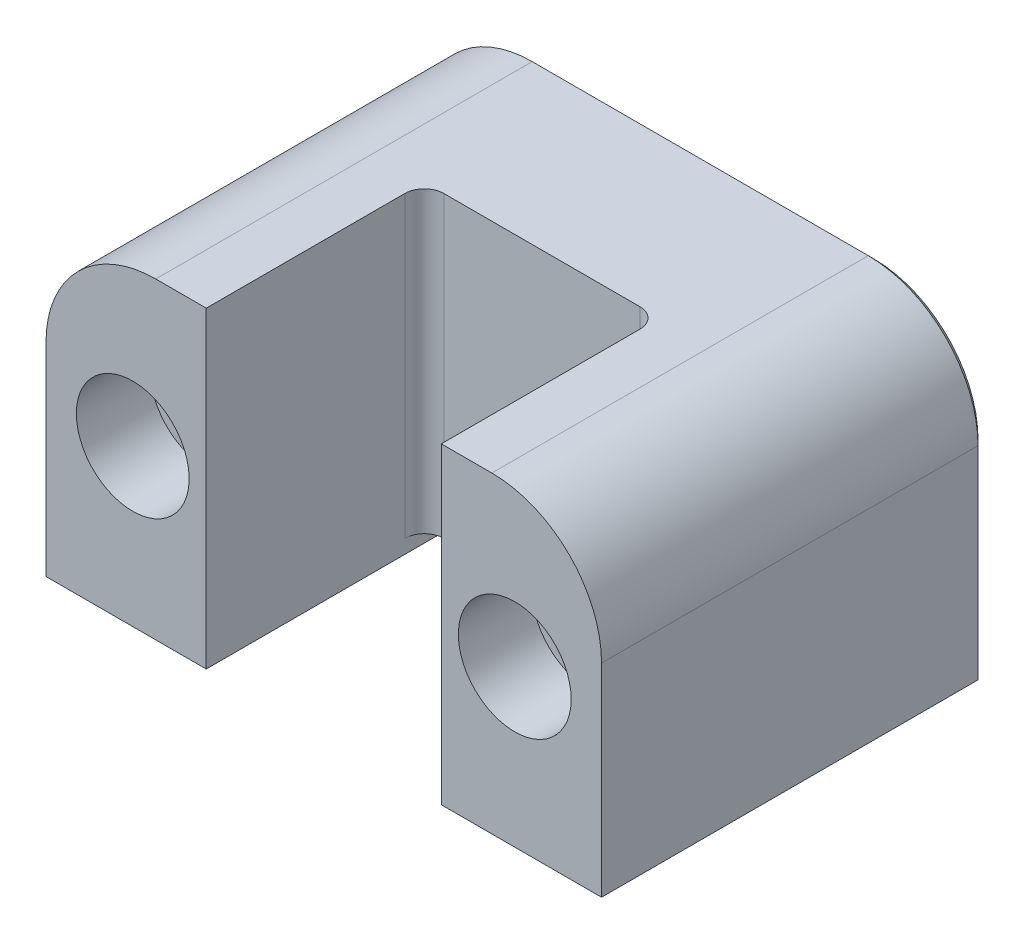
ISO-10303-21;
HEADER;
FILE_DESCRIPTION(('STEP AP214'),'2;1');
FILE_NAME('part.step','',(''),(''),'','','');
FILE_SCHEMA(('AUTOMOTIVE_DESIGN { 1 0 10303 214 1 1 1 1 }'));
ENDSEC;
DATA;
#1=APPLICATION_CONTEXT('core data for automotive mechanical design processes');
#2=APPLICATION_PROTOCOL_DEFINITION('international standard','automotive_design',2000,#1);
#3=PRODUCT_CONTEXT('',#1,'mechanical');
#4=PRODUCT('Part','Part','',(#3));
#5=PRODUCT_RELATED_PRODUCT_CATEGORY('part','',(#4));
#6=PRODUCT_DEFINITION_FORMATION('','',#4);
#7=PRODUCT_DEFINITION_CONTEXT('part definition',#1,'design');
#8=PRODUCT_DEFINITION('design','',#6,#7);
#9=PRODUCT_DEFINITION_SHAPE('','',#8);
#10=(LENGTH_UNIT() NAMED_UNIT(*) SI_UNIT(.MILLI.,.METRE.));
#11=(NAMED_UNIT(*) PLANE_ANGLE_UNIT() SI_UNIT($,.RADIAN.));
#12=(NAMED_UNIT(*) SI_UNIT($,.STERADIAN.) SOLID_ANGLE_UNIT());
#13=UNCERTAINTY_MEASURE_WITH_UNIT(LENGTH_MEASURE(1.E-05),#10,'distance_accuracy_value','');
#14=(GEOMETRIC_REPRESENTATION_CONTEXT(3) GLOBAL_UNCERTAINTY_ASSIGNED_CONTEXT((#13)) GLOBAL_UNIT_ASSIGNED_CONTEXT((#10,
#11,#12)) REPRESENTATION_CONTEXT('',''));
#15=CARTESIAN_POINT('',(0.,0.,0.));
#16=DIRECTION('',(0.,0.,1.));
#17=DIRECTION('',(1.,0.,0.));
#18=AXIS2_PLACEMENT_3D('',#15,#16,#17);
#19=CARTESIAN_POINT('',(-25.39365,28.575,-34.925));
#20=DIRECTION('',(0.,0.,1.));
#21=DIRECTION('',(1.,0.,0.));
#22=AXIS2_PLACEMENT_3D('',#19,#20,#21);
#23=PLANE('',#22);
#24=CARTESIAN_POINT('',(-17.4625,14.2875,-34.925));
#25=DIRECTION('',(0.,0.,-1.));
#26=DIRECTION('',(-1.,0.,0.));
#27=AXIS2_PLACEMENT_3D('',#24,#25,#26);
#28=CIRCLE('',#27,3.5687);
#29=CARTESIAN_POINT('',(-21.0312,14.2875,-34.925));
#30=VERTEX_POINT('',#29);
#31=EDGE_CURVE('E322',#30,#30,#28,.T.);
#32=ORIENTED_EDGE('',*,*,#31,.F.);
#33=EDGE_LOOP('',(#32));
#34=FACE_BOUND('',#33,.T.);
#35=CARTESIAN_POINT('',(15.36065,18.542,-34.925));
#36=DIRECTION('',(0.,0.,1.));
#37=DIRECTION('',(1.,0.,0.));
#38=AXIS2_PLACEMENT_3D('',#35,#36,#37);
#39=CIRCLE('',#38,9.52500000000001);
#40=CARTESIAN_POINT('',(15.36065,28.067,-34.925));
#41=VERTEX_POINT('',#40);
#42=CARTESIAN_POINT('',(24.88565,18.542,-34.925));
#43=VERTEX_POINT('',#42);
#44=EDGE_CURVE('E275',#41,#43,#39,.F.);
#45=ORIENTED_EDGE('',*,*,#44,.T.);
#46=DIRECTION('',(0.,-1.,0.));
#47=VECTOR('',#46,1.);
#48=CARTESIAN_POINT('',(24.88565,28.575,-34.925));
#49=LINE('',#48,#47);
#50=CARTESIAN_POINT('',(24.88565,0.,-34.925));
#51=VERTEX_POINT('',#50);
#52=EDGE_CURVE('E279',#43,#51,#49,.T.);
#53=ORIENTED_EDGE('',*,*,#52,.T.);
#54=DIRECTION('',(-1.,0.,0.));
#55=VECTOR('',#54,1.);
#56=CARTESIAN_POINT('',(-25.39365,0.,-34.925));
#57=LINE('',#56,#55);
#58=CARTESIAN_POINT('',(-24.88565,0.,-34.925));
#59=VERTEX_POINT('',#58);
#60=EDGE_CURVE('E173',#51,#59,#57,.T.);
#61=ORIENTED_EDGE('',*,*,#60,.T.);
#62=DIRECTION('',(0.,1.,0.));
#63=VECTOR('',#62,1.);
#64=CARTESIAN_POINT('',(-24.88565,28.575,-34.925));
#65=LINE('',#64,#63);
#66=CARTESIAN_POINT('',(-24.88565,18.542,-34.925));
#67=VERTEX_POINT('',#66);
#68=EDGE_CURVE('E277',#59,#67,#65,.T.);
#69=ORIENTED_EDGE('',*,*,#68,.T.);
#70=CARTESIAN_POINT('',(-15.36065,18.542,-34.925));
#71=DIRECTION('',(0.,0.,1.));
#72=DIRECTION('',(1.,0.,0.));
#73=AXIS2_PLACEMENT_3D('',#70,#71,#72);
#74=CIRCLE('',#73,9.52500000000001);
#75=CARTESIAN_POINT('',(-15.36065,28.067,-34.925));
#76=VERTEX_POINT('',#75);
#77=EDGE_CURVE('E273',#67,#76,#74,.F.);
#78=ORIENTED_EDGE('',*,*,#77,.T.);
#79=DIRECTION('',(1.,0.,0.));
#80=VECTOR('',#79,1.);
#81=CARTESIAN_POINT('',(-25.39365,28.067,-34.925));
#82=LINE('',#81,#80);
#83=EDGE_CURVE('E271',#76,#41,#82,.T.);
#84=ORIENTED_EDGE('',*,*,#83,.T.);
#85=EDGE_LOOP('',(#45,#53,#61,#69,#78,#84));
#86=FACE_BOUND('',#85,.T.);
#87=CARTESIAN_POINT('',(17.4625,14.2875,-34.925));
#88=DIRECTION('',(0.,0.,1.));
#89=DIRECTION('',(1.,0.,0.));
#90=AXIS2_PLACEMENT_3D('',#87,#88,#89);
#91=CIRCLE('',#90,3.5687);
#92=CARTESIAN_POINT('',(21.0312,14.2875,-34.925));
#93=VERTEX_POINT('',#92);
#94=EDGE_CURVE('E303',#93,#93,#91,.T.);
#95=ORIENTED_EDGE('',*,*,#94,.T.);
#96=EDGE_LOOP('',(#95));
#97=FACE_BOUND('',#96,.T.);
#98=ADVANCED_FACE('F32',(#34,#86,#97),#23,.F.);
#99=CARTESIAN_POINT('',(10.7442,28.575,0.));
#100=DIRECTION('',(0.,0.,-1.));
#101=DIRECTION('',(-1.,0.,0.));
#102=AXIS2_PLACEMENT_3D('',#99,#100,#101);
#103=PLANE('',#102);
#104=DIRECTION('',(0.,-1.,0.));
#105=VECTOR('',#104,1.);
#106=CARTESIAN_POINT('',(25.39365,28.575,0.));
#107=LINE('',#106,#105);
#108=CARTESIAN_POINT('',(25.39365,18.542,0.));
#109=VERTEX_POINT('',#108);
#110=CARTESIAN_POINT('',(25.39365,0.,0.));
#111=VERTEX_POINT('',#110);
#112=EDGE_CURVE('E202',#109,#111,#107,.T.);
#113=ORIENTED_EDGE('',*,*,#112,.F.);
#114=CARTESIAN_POINT('',(15.36065,18.542,0.));
#115=DIRECTION('',(0.,0.,-1.));
#116=DIRECTION('',(-1.,0.,0.));
#117=AXIS2_PLACEMENT_3D('',#114,#115,#116);
#118=CIRCLE('',#117,10.033);
#119=CARTESIAN_POINT('',(15.36065,28.575,0.));
#120=VERTEX_POINT('',#119);
#121=EDGE_CURVE('E264',#109,#120,#118,.F.);
#122=ORIENTED_EDGE('',*,*,#121,.T.);
#123=DIRECTION('',(1.,0.,0.));
#124=VECTOR('',#123,1.);
#125=CARTESIAN_POINT('',(10.7442,28.575,0.));
#126=LINE('',#125,#124);
#127=CARTESIAN_POINT('',(10.7442,28.575,0.));
#128=VERTEX_POINT('',#127);
#129=EDGE_CURVE('E199',#128,#120,#126,.T.);
#130=ORIENTED_EDGE('',*,*,#129,.F.);
#131=DIRECTION('',(0.,-1.,0.));
#132=VECTOR('',#131,1.);
#133=CARTESIAN_POINT('',(10.7442,28.575,0.));
#134=LINE('',#133,#132);
#135=CARTESIAN_POINT('',(10.7442,0.,0.));
#136=VERTEX_POINT('',#135);
#137=EDGE_CURVE('E186',#128,#136,#134,.T.);
#138=ORIENTED_EDGE('',*,*,#137,.T.);
#139=DIRECTION('',(1.,0.,0.));
#140=VECTOR('',#139,1.);
#141=CARTESIAN_POINT('',(10.7442,0.,0.));
#142=LINE('',#141,#140);
#143=EDGE_CURVE('E211',#136,#111,#142,.T.);
#144=ORIENTED_EDGE('',*,*,#143,.T.);
#145=EDGE_LOOP('',(#113,#122,#130,#138,#144));
#146=FACE_BOUND('',#145,.T.);
#147=CARTESIAN_POINT('',(17.4625,14.2875,0.));
#148=DIRECTION('',(0.,0.,1.));
#149=DIRECTION('',(1.,0.,0.));
#150=AXIS2_PLACEMENT_3D('',#147,#148,#149);
#151=CIRCLE('',#150,5.1562);
#152=CARTESIAN_POINT('',(22.6187,14.2875,0.));
#153=VERTEX_POINT('',#152);
#154=EDGE_CURVE('E319',#153,#153,#151,.T.);
#155=ORIENTED_EDGE('',*,*,#154,.F.);
#156=EDGE_LOOP('',(#155));
#157=FACE_BOUND('',#156,.T.);
#158=ADVANCED_FACE('F367',(#146,#157),#103,.F.);
#159=CARTESIAN_POINT('',(-25.39365,28.575,0.));
#160=DIRECTION('',(0.,0.,-1.));
#161=DIRECTION('',(-1.,0.,0.));
#162=AXIS2_PLACEMENT_3D('',#159,#160,#161);
#163=PLANE('',#162);
#164=DIRECTION('',(1.,0.,0.));
#165=VECTOR('',#164,1.);
#166=CARTESIAN_POINT('',(-25.39365,28.575,0.));
#167=LINE('',#166,#165);
#168=CARTESIAN_POINT('',(-15.36065,28.575,0.));
#169=VERTEX_POINT('',#168);
#170=CARTESIAN_POINT('',(-10.7442,28.575,0.));
#171=VERTEX_POINT('',#170);
#172=EDGE_CURVE('E164',#169,#171,#167,.T.);
#173=ORIENTED_EDGE('',*,*,#172,.F.);
#174=CARTESIAN_POINT('',(-15.36065,18.542,0.));
#175=DIRECTION('',(0.,0.,-1.));
#176=DIRECTION('',(-1.,0.,0.));
#177=AXIS2_PLACEMENT_3D('',#174,#175,#176);
#178=CIRCLE('',#177,10.033);
#179=CARTESIAN_POINT('',(-25.39365,18.542,0.));
#180=VERTEX_POINT('',#179);
#181=EDGE_CURVE('E266',#169,#180,#178,.F.);
#182=ORIENTED_EDGE('',*,*,#181,.T.);
#183=DIRECTION('',(0.,-1.,0.));
#184=VECTOR('',#183,1.);
#185=CARTESIAN_POINT('',(-25.39365,28.575,0.));
#186=LINE('',#185,#184);
#187=CARTESIAN_POINT('',(-25.39365,0.,0.));
#188=VERTEX_POINT('',#187);
#189=EDGE_CURVE('E185',#180,#188,#186,.T.);
#190=ORIENTED_EDGE('',*,*,#189,.T.);
#191=DIRECTION('',(1.,0.,0.));
#192=VECTOR('',#191,1.);
#193=CARTESIAN_POINT('',(-25.39365,0.,0.));
#194=LINE('',#193,#192);
#195=CARTESIAN_POINT('',(-10.7442,0.,0.));
#196=VERTEX_POINT('',#195);
#197=EDGE_CURVE('E181',#188,#196,#194,.T.);
#198=ORIENTED_EDGE('',*,*,#197,.T.);
#199=DIRECTION('',(0.,-1.,0.));
#200=VECTOR('',#199,1.);
#201=CARTESIAN_POINT('',(-10.7442,28.575,0.));
#202=LINE('',#201,#200);
#203=EDGE_CURVE('E176',#171,#196,#202,.T.);
#204=ORIENTED_EDGE('',*,*,#203,.F.);
#205=EDGE_LOOP('',(#173,#182,#190,#198,#204));
#206=FACE_BOUND('',#205,.T.);
#207=CARTESIAN_POINT('',(-17.4625,14.2875,0.));
#208=DIRECTION('',(0.,0.,-1.));
#209=DIRECTION('',(-1.,0.,0.));
#210=AXIS2_PLACEMENT_3D('',#207,#208,#209);
#211=CIRCLE('',#210,5.1562);
#212=CARTESIAN_POINT('',(-22.6187,14.2875,0.));
#213=VERTEX_POINT('',#212);
#214=EDGE_CURVE('E331',#213,#213,#211,.T.);
#215=ORIENTED_EDGE('',*,*,#214,.T.);
#216=EDGE_LOOP('',(#215));
#217=FACE_BOUND('',#216,.T.);
#218=ADVANCED_FACE('F177',(#206,#217),#163,.F.);
#219=CARTESIAN_POINT('',(-25.39365,28.575,0.));
#220=DIRECTION('',(1.,0.,0.));
#221=DIRECTION('',(0.,0.,-1.));
#222=AXIS2_PLACEMENT_3D('',#219,#220,#221);
#223=PLANE('',#222);
#224=DIRECTION('',(0.,0.,1.));
#225=VECTOR('',#224,1.);
#226=CARTESIAN_POINT('',(-25.39365,18.542,0.));
#227=LINE('',#226,#225);
#228=CARTESIAN_POINT('',(-25.39365,18.542,-34.417));
#229=VERTEX_POINT('',#228);
#230=EDGE_CURVE('E268',#180,#229,#227,.F.);
#231=ORIENTED_EDGE('',*,*,#230,.T.);
#232=DIRECTION('',(0.,-1.,0.));
#233=VECTOR('',#232,1.);
#234=CARTESIAN_POINT('',(-25.39365,28.575,-34.417));
#235=LINE('',#234,#233);
#236=CARTESIAN_POINT('',(-25.39365,0.,-34.417));
#237=VERTEX_POINT('',#236);
#238=EDGE_CURVE('E288',#229,#237,#235,.T.);
#239=ORIENTED_EDGE('',*,*,#238,.T.);
#240=DIRECTION('',(0.,0.,1.));
#241=VECTOR('',#240,1.);
#242=CARTESIAN_POINT('',(-25.39365,0.,0.));
#243=LINE('',#242,#241);
#244=EDGE_CURVE('E203',#237,#188,#243,.T.);
#245=ORIENTED_EDGE('',*,*,#244,.T.);
#246=ORIENTED_EDGE('',*,*,#189,.F.);
#247=EDGE_LOOP('',(#231,#239,#245,#246));
#248=FACE_BOUND('',#247,.T.);
#249=ADVANCED_FACE('F420',(#248),#223,.F.);
#250=CARTESIAN_POINT('',(-10.7442,28.575,0.));
#251=DIRECTION('',(-1.,0.,0.));
#252=DIRECTION('',(0.,0.,1.));
#253=AXIS2_PLACEMENT_3D('',#250,#251,#252);
#254=PLANE('',#253);
#255=DIRECTION('',(0.,0.,-1.));
#256=VECTOR('',#255,1.);
#257=CARTESIAN_POINT('',(-10.7442,1.27,-26.543));
#258=LINE('',#257,#256);
#259=CARTESIAN_POINT('',(-10.7442,1.27,-18.161));
#260=VERTEX_POINT('',#259);
#261=CARTESIAN_POINT('',(-10.7442,1.27,-24.511));
#262=VERTEX_POINT('',#261);
#263=EDGE_CURVE('E335',#260,#262,#258,.T.);
#264=ORIENTED_EDGE('',*,*,#263,.F.);
#265=DIRECTION('',(0.,-1.,0.));
#266=VECTOR('',#265,1.);
#267=CARTESIAN_POINT('',(-10.7442,28.575,-18.161));
#268=LINE('',#267,#266);
#269=CARTESIAN_POINT('',(-10.7442,28.575,-18.161));
#270=VERTEX_POINT('',#269);
#271=EDGE_CURVE('E190',#260,#270,#268,.F.);
#272=ORIENTED_EDGE('',*,*,#271,.T.);
#273=DIRECTION('',(0.,0.,-1.));
#274=VECTOR('',#273,1.);
#275=CARTESIAN_POINT('',(-10.7442,28.575,0.));
#276=LINE('',#275,#274);
#277=EDGE_CURVE('E168',#171,#270,#276,.T.);
#278=ORIENTED_EDGE('',*,*,#277,.F.);
#279=ORIENTED_EDGE('',*,*,#203,.T.);
#280=DIRECTION('',(0.,0.,-1.));
#281=VECTOR('',#280,1.);
#282=CARTESIAN_POINT('',(-10.7442,0.,0.));
#283=LINE('',#282,#281);
#284=CARTESIAN_POINT('',(-10.7442,0.,-24.511));
#285=VERTEX_POINT('',#284);
#286=EDGE_CURVE('E207',#196,#285,#283,.T.);
#287=ORIENTED_EDGE('',*,*,#286,.T.);
#288=DIRECTION('',(0.,-1.,0.));
#289=VECTOR('',#288,1.);
#290=CARTESIAN_POINT('',(-10.7442,1.27,-24.511));
#291=LINE('',#290,#289);
#292=EDGE_CURVE('E235',#285,#262,#291,.F.);
#293=ORIENTED_EDGE('',*,*,#292,.T.);
#294=EDGE_LOOP('',(#264,#272,#278,#279,#287,#293));
#295=FACE_BOUND('',#294,.T.);
#296=ADVANCED_FACE('F188',(#295),#254,.F.);
#297=CARTESIAN_POINT('',(-10.7442,28.575,-19.939));
#298=DIRECTION('',(0.,0.,-1.));
#299=DIRECTION('',(-1.,0.,0.));
#300=AXIS2_PLACEMENT_3D('',#297,#298,#299);
#301=PLANE('',#300);
#302=DIRECTION('',(1.,0.,0.));
#303=VECTOR('',#302,1.);
#304=CARTESIAN_POINT('',(-10.7442,1.27,-19.939));
#305=LINE('',#304,#303);
#306=CARTESIAN_POINT('',(-8.9662,1.27,-19.939));
#307=VERTEX_POINT('',#306);
#308=CARTESIAN_POINT('',(8.9662,1.27,-19.939));
#309=VERTEX_POINT('',#308);
#310=EDGE_CURVE('E205',#307,#309,#305,.T.);
#311=ORIENTED_EDGE('',*,*,#310,.T.);
#312=DIRECTION('',(0.,-1.,0.));
#313=VECTOR('',#312,1.);
#314=CARTESIAN_POINT('',(8.9662,28.575,-19.939));
#315=LINE('',#314,#313);
#316=CARTESIAN_POINT('',(8.9662,28.575,-19.939));
#317=VERTEX_POINT('',#316);
#318=EDGE_CURVE('E247',#309,#317,#315,.F.);
#319=ORIENTED_EDGE('',*,*,#318,.T.);
#320=DIRECTION('',(1.,0.,0.));
#321=VECTOR('',#320,1.);
#322=CARTESIAN_POINT('',(-10.7442,28.575,-19.939));
#323=LINE('',#322,#321);
#324=CARTESIAN_POINT('',(-8.9662,28.575,-19.939));
#325=VERTEX_POINT('',#324);
#326=EDGE_CURVE('E191',#325,#317,#323,.T.);
#327=ORIENTED_EDGE('',*,*,#326,.F.);
#328=DIRECTION('',(0.,-1.,0.));
#329=VECTOR('',#328,1.);
#330=CARTESIAN_POINT('',(-8.9662,1.27,-19.939));
#331=LINE('',#330,#329);
#332=EDGE_CURVE('E244',#325,#307,#331,.T.);
#333=ORIENTED_EDGE('',*,*,#332,.T.);
#334=EDGE_LOOP('',(#311,#319,#327,#333));
#335=FACE_BOUND('',#334,.T.);
#336=ADVANCED_FACE('F348',(#335),#301,.F.);
#337=CARTESIAN_POINT('',(10.7442,28.575,0.));
#338=DIRECTION('',(1.,0.,0.));
#339=DIRECTION('',(0.,0.,-1.));
#340=AXIS2_PLACEMENT_3D('',#337,#338,#339);
#341=PLANE('',#340);
#342=DIRECTION('',(0.,0.,1.));
#343=VECTOR('',#342,1.);
#344=CARTESIAN_POINT('',(10.7442,28.575,0.));
#345=LINE('',#344,#343);
#346=CARTESIAN_POINT('',(10.7442,28.575,-18.161));
#347=VERTEX_POINT('',#346);
#348=EDGE_CURVE('E194',#347,#128,#345,.T.);
#349=ORIENTED_EDGE('',*,*,#348,.F.);
#350=DIRECTION('',(0.,-1.,0.));
#351=VECTOR('',#350,1.);
#352=CARTESIAN_POINT('',(10.7442,1.27,-18.161));
#353=LINE('',#352,#351);
#354=CARTESIAN_POINT('',(10.7442,1.27,-18.161));
#355=VERTEX_POINT('',#354);
#356=EDGE_CURVE('E241',#347,#355,#353,.T.);
#357=ORIENTED_EDGE('',*,*,#356,.T.);
#358=DIRECTION('',(0.,0.,1.));
#359=VECTOR('',#358,1.);
#360=CARTESIAN_POINT('',(10.7442,1.27,-26.543));
#361=LINE('',#360,#359);
#362=CARTESIAN_POINT('',(10.7442,1.27,-24.511));
#363=VERTEX_POINT('',#362);
#364=EDGE_CURVE('E341',#363,#355,#361,.T.);
#365=ORIENTED_EDGE('',*,*,#364,.F.);
#366=DIRECTION('',(0.,-1.,0.));
#367=VECTOR('',#366,1.);
#368=CARTESIAN_POINT('',(10.7442,0.,-24.511));
#369=LINE('',#368,#367);
#370=CARTESIAN_POINT('',(10.7442,0.,-24.511));
#371=VERTEX_POINT('',#370);
#372=EDGE_CURVE('E223',#363,#371,#369,.T.);
#373=ORIENTED_EDGE('',*,*,#372,.T.);
#374=DIRECTION('',(0.,0.,1.));
#375=VECTOR('',#374,1.);
#376=CARTESIAN_POINT('',(10.7442,0.,0.));
#377=LINE('',#376,#375);
#378=EDGE_CURVE('E209',#371,#136,#377,.T.);
#379=ORIENTED_EDGE('',*,*,#378,.T.);
#380=ORIENTED_EDGE('',*,*,#137,.F.);
#381=EDGE_LOOP('',(#349,#357,#365,#373,#379,#380));
#382=FACE_BOUND('',#381,.T.);
#383=ADVANCED_FACE('F360',(#382),#341,.F.);
#384=CARTESIAN_POINT('',(25.39365,28.575,0.));
#385=DIRECTION('',(-1.,0.,0.));
#386=DIRECTION('',(0.,0.,1.));
#387=AXIS2_PLACEMENT_3D('',#384,#385,#386);
#388=PLANE('',#387);
#389=DIRECTION('',(0.,0.,-1.));
#390=VECTOR('',#389,1.);
#391=CARTESIAN_POINT('',(25.39365,0.,0.));
#392=LINE('',#391,#390);
#393=CARTESIAN_POINT('',(25.39365,0.,-34.417));
#394=VERTEX_POINT('',#393);
#395=EDGE_CURVE('E214',#111,#394,#392,.T.);
#396=ORIENTED_EDGE('',*,*,#395,.T.);
#397=DIRECTION('',(0.,1.,0.));
#398=VECTOR('',#397,1.);
#399=CARTESIAN_POINT('',(25.39365,28.575,-34.417));
#400=LINE('',#399,#398);
#401=CARTESIAN_POINT('',(25.39365,18.542,-34.417));
#402=VERTEX_POINT('',#401);
#403=EDGE_CURVE('E286',#394,#402,#400,.T.);
#404=ORIENTED_EDGE('',*,*,#403,.T.);
#405=DIRECTION('',(0.,0.,-1.));
#406=VECTOR('',#405,1.);
#407=CARTESIAN_POINT('',(25.39365,18.542,0.));
#408=LINE('',#407,#406);
#409=EDGE_CURVE('E262',#402,#109,#408,.F.);
#410=ORIENTED_EDGE('',*,*,#409,.T.);
#411=ORIENTED_EDGE('',*,*,#112,.T.);
#412=EDGE_LOOP('',(#396,#404,#410,#411));
#413=FACE_BOUND('',#412,.T.);
#414=ADVANCED_FACE('F411',(#413),#388,.F.);
#415=CARTESIAN_POINT('',(-25.39365,28.575,-34.925));
#416=DIRECTION('',(0.,-1.,0.));
#417=DIRECTION('',(0.,0.,-1.));
#418=AXIS2_PLACEMENT_3D('',#415,#416,#417);
#419=PLANE('',#418);
#420=DIRECTION('',(0.,0.,-1.));
#421=VECTOR('',#420,1.);
#422=CARTESIAN_POINT('',(15.36065,28.575,-34.925));
#423=LINE('',#422,#421);
#424=CARTESIAN_POINT('',(15.36065,28.575,-34.417));
#425=VERTEX_POINT('',#424);
#426=EDGE_CURVE('E260',#120,#425,#423,.T.);
#427=ORIENTED_EDGE('',*,*,#426,.T.);
#428=DIRECTION('',(-1.,0.,0.));
#429=VECTOR('',#428,1.);
#430=CARTESIAN_POINT('',(-25.39365,28.575,-34.417));
#431=LINE('',#430,#429);
#432=CARTESIAN_POINT('',(-15.36065,28.575,-34.417));
#433=VERTEX_POINT('',#432);
#434=EDGE_CURVE('E11',#425,#433,#431,.T.);
#435=ORIENTED_EDGE('',*,*,#434,.T.);
#436=DIRECTION('',(0.,0.,1.));
#437=VECTOR('',#436,1.);
#438=CARTESIAN_POINT('',(-15.36065,28.575,-34.925));
#439=LINE('',#438,#437);
#440=EDGE_CURVE('E170',#433,#169,#439,.T.);
#441=ORIENTED_EDGE('',*,*,#440,.T.);
#442=ORIENTED_EDGE('',*,*,#172,.T.);
#443=ORIENTED_EDGE('',*,*,#277,.T.);
#444=CARTESIAN_POINT('',(-8.9662,28.575,-18.161));
#445=DIRECTION('',(0.,-1.,0.));
#446=DIRECTION('',(0.,0.,-1.));
#447=AXIS2_PLACEMENT_3D('',#444,#445,#446);
#448=CIRCLE('',#447,1.778);
#449=EDGE_CURVE('E257',#270,#325,#448,.T.);
#450=ORIENTED_EDGE('',*,*,#449,.T.);
#451=ORIENTED_EDGE('',*,*,#326,.T.);
#452=CARTESIAN_POINT('',(8.9662,28.575,-18.161));
#453=DIRECTION('',(0.,-1.,0.));
#454=DIRECTION('',(0.,0.,-1.));
#455=AXIS2_PLACEMENT_3D('',#452,#453,#454);
#456=CIRCLE('',#455,1.778);
#457=EDGE_CURVE('E252',#317,#347,#456,.T.);
#458=ORIENTED_EDGE('',*,*,#457,.T.);
#459=ORIENTED_EDGE('',*,*,#348,.T.);
#460=ORIENTED_EDGE('',*,*,#129,.T.);
#461=EDGE_LOOP('',(#427,#435,#441,#442,#443,#450,#451,#458,#459,#460));
#462=FACE_BOUND('',#461,.T.);
#463=ADVANCED_FACE('F166',(#462),#419,.F.);
#464=CARTESIAN_POINT('',(-25.39365,0.,-34.925));
#465=DIRECTION('',(0.,-1.,0.));
#466=DIRECTION('',(0.,0.,-1.));
#467=AXIS2_PLACEMENT_3D('',#464,#465,#466);
#468=PLANE('',#467);
#469=ORIENTED_EDGE('',*,*,#60,.F.);
#470=DIRECTION('',(-0.707106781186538,0.,-0.707106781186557));
#471=VECTOR('',#470,1.);
#472=CARTESIAN_POINT('',(-0.25399999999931,0.,-60.06465));
#473=LINE('',#472,#471);
#474=EDGE_CURVE('E284',#51,#394,#473,.F.);
#475=ORIENTED_EDGE('',*,*,#474,.T.);
#476=ORIENTED_EDGE('',*,*,#395,.F.);
#477=ORIENTED_EDGE('',*,*,#143,.F.);
#478=ORIENTED_EDGE('',*,*,#378,.F.);
#479=CARTESIAN_POINT('',(8.7122,0.,-24.511));
#480=DIRECTION('',(0.,-1.,0.));
#481=DIRECTION('',(0.,0.,-1.));
#482=AXIS2_PLACEMENT_3D('',#479,#480,#481);
#483=CIRCLE('',#482,2.032);
#484=CARTESIAN_POINT('',(8.7122,0.,-26.543));
#485=VERTEX_POINT('',#484);
#486=EDGE_CURVE('E237',#371,#485,#483,.F.);
#487=ORIENTED_EDGE('',*,*,#486,.T.);
#488=DIRECTION('',(1.,0.,0.));
#489=VECTOR('',#488,1.);
#490=CARTESIAN_POINT('',(-10.7442,0.,-26.543));
#491=LINE('',#490,#489);
#492=CARTESIAN_POINT('',(-8.7122,0.,-26.543));
#493=VERTEX_POINT('',#492);
#494=EDGE_CURVE('E334',#493,#485,#491,.T.);
#495=ORIENTED_EDGE('',*,*,#494,.F.);
#496=CARTESIAN_POINT('',(-8.7122,0.,-24.511));
#497=DIRECTION('',(0.,-1.,0.));
#498=DIRECTION('',(0.,0.,-1.));
#499=AXIS2_PLACEMENT_3D('',#496,#497,#498);
#500=CIRCLE('',#499,2.032);
#501=EDGE_CURVE('E239',#493,#285,#500,.F.);
#502=ORIENTED_EDGE('',*,*,#501,.T.);
#503=ORIENTED_EDGE('',*,*,#286,.F.);
#504=ORIENTED_EDGE('',*,*,#197,.F.);
#505=ORIENTED_EDGE('',*,*,#244,.F.);
#506=DIRECTION('',(-0.707106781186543,0.,0.707106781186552));
#507=VECTOR('',#506,1.);
#508=CARTESIAN_POINT('',(-25.13965,0.,-34.671));
#509=LINE('',#508,#507);
#510=EDGE_CURVE('E282',#237,#59,#509,.F.);
#511=ORIENTED_EDGE('',*,*,#510,.T.);
#512=EDGE_LOOP('',(#469,#475,#476,#477,#478,#487,#495,#502,#503,#504,#505,#511));
#513=FACE_BOUND('',#512,.T.);
#514=ADVANCED_FACE('F385',(#513),#468,.T.);
#515=CARTESIAN_POINT('',(-10.7442,1.27,-14.7728747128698));
#516=DIRECTION('',(0.,1.,0.));
#517=DIRECTION('',(0.,0.,1.));
#518=AXIS2_PLACEMENT_3D('',#515,#516,#517);
#519=PLANE('',#518);
#520=DIRECTION('',(1.,0.,0.));
#521=VECTOR('',#520,1.);
#522=CARTESIAN_POINT('',(-10.7442,1.27,-26.543));
#523=LINE('',#522,#521);
#524=CARTESIAN_POINT('',(-8.7122,1.27,-26.543));
#525=VERTEX_POINT('',#524);
#526=CARTESIAN_POINT('',(8.7122,1.27,-26.543));
#527=VERTEX_POINT('',#526);
#528=EDGE_CURVE('E338',#525,#527,#523,.T.);
#529=ORIENTED_EDGE('',*,*,#528,.T.);
#530=CARTESIAN_POINT('',(8.7122,1.27,-24.511));
#531=DIRECTION('',(0.,1.,0.));
#532=DIRECTION('',(0.,0.,1.));
#533=AXIS2_PLACEMENT_3D('',#530,#531,#532);
#534=CIRCLE('',#533,2.032);
#535=EDGE_CURVE('E233',#527,#363,#534,.F.);
#536=ORIENTED_EDGE('',*,*,#535,.T.);
#537=ORIENTED_EDGE('',*,*,#364,.T.);
#538=CARTESIAN_POINT('',(8.9662,1.27,-18.161));
#539=DIRECTION('',(0.,1.,0.));
#540=DIRECTION('',(0.,0.,1.));
#541=AXIS2_PLACEMENT_3D('',#538,#539,#540);
#542=CIRCLE('',#541,1.778);
#543=EDGE_CURVE('E250',#355,#309,#542,.T.);
#544=ORIENTED_EDGE('',*,*,#543,.T.);
#545=ORIENTED_EDGE('',*,*,#310,.F.);
#546=CARTESIAN_POINT('',(-8.9662,1.27,-18.161));
#547=DIRECTION('',(0.,1.,0.));
#548=DIRECTION('',(0.,0.,1.));
#549=AXIS2_PLACEMENT_3D('',#546,#547,#548);
#550=CIRCLE('',#549,1.778);
#551=EDGE_CURVE('E254',#307,#260,#550,.T.);
#552=ORIENTED_EDGE('',*,*,#551,.T.);
#553=ORIENTED_EDGE('',*,*,#263,.T.);
#554=CARTESIAN_POINT('',(-8.7122,1.27,-24.511));
#555=DIRECTION('',(0.,1.,0.));
#556=DIRECTION('',(0.,0.,1.));
#557=AXIS2_PLACEMENT_3D('',#554,#555,#556);
#558=CIRCLE('',#557,2.032);
#559=EDGE_CURVE('E231',#262,#525,#558,.F.);
#560=ORIENTED_EDGE('',*,*,#559,.T.);
#561=EDGE_LOOP('',(#529,#536,#537,#544,#545,#552,#553,#560));
#562=FACE_BOUND('',#561,.T.);
#563=ADVANCED_FACE('F496',(#562),#519,.F.);
#564=CARTESIAN_POINT('',(-10.7442,1.27,-26.543));
#565=DIRECTION('',(0.,0.,-1.));
#566=DIRECTION('',(-1.,0.,0.));
#567=AXIS2_PLACEMENT_3D('',#564,#565,#566);
#568=PLANE('',#567);
#569=ORIENTED_EDGE('',*,*,#494,.T.);
#570=DIRECTION('',(0.,-1.,0.));
#571=VECTOR('',#570,1.);
#572=CARTESIAN_POINT('',(8.7122,1.27,-26.543));
#573=LINE('',#572,#571);
#574=EDGE_CURVE('E229',#485,#527,#573,.F.);
#575=ORIENTED_EDGE('',*,*,#574,.T.);
#576=ORIENTED_EDGE('',*,*,#528,.F.);
#577=DIRECTION('',(0.,-1.,0.));
#578=VECTOR('',#577,1.);
#579=CARTESIAN_POINT('',(-8.7122,0.,-26.543));
#580=LINE('',#579,#578);
#581=EDGE_CURVE('E226',#525,#493,#580,.T.);
#582=ORIENTED_EDGE('',*,*,#581,.T.);
#583=EDGE_LOOP('',(#569,#575,#576,#582));
#584=FACE_BOUND('',#583,.T.);
#585=ADVANCED_FACE('F430',(#584),#568,.F.);
#586=CARTESIAN_POINT('',(8.7122,28.575,-24.511));
#587=DIRECTION('',(0.,1.,0.));
#588=DIRECTION('',(0.,0.,1.));
#589=AXIS2_PLACEMENT_3D('',#586,#587,#588);
#590=CYLINDRICAL_SURFACE('',#589,2.032);
#591=ORIENTED_EDGE('',*,*,#535,.F.);
#592=ORIENTED_EDGE('',*,*,#574,.F.);
#593=ORIENTED_EDGE('',*,*,#486,.F.);
#594=ORIENTED_EDGE('',*,*,#372,.F.);
#595=EDGE_LOOP('',(#591,#592,#593,#594));
#596=FACE_BOUND('',#595,.T.);
#597=ADVANCED_FACE('F426',(#596),#590,.F.);
#598=CARTESIAN_POINT('',(-8.7122,1.27,-24.511));
#599=DIRECTION('',(0.,1.,0.));
#600=DIRECTION('',(0.,0.,1.));
#601=AXIS2_PLACEMENT_3D('',#598,#599,#600);
#602=CYLINDRICAL_SURFACE('',#601,2.032);
#603=ORIENTED_EDGE('',*,*,#559,.F.);
#604=ORIENTED_EDGE('',*,*,#292,.F.);
#605=ORIENTED_EDGE('',*,*,#501,.F.);
#606=ORIENTED_EDGE('',*,*,#581,.F.);
#607=EDGE_LOOP('',(#603,#604,#605,#606));
#608=FACE_BOUND('',#607,.T.);
#609=ADVANCED_FACE('F429',(#608),#602,.F.);
#610=CARTESIAN_POINT('',(8.9662,28.575,-18.161));
#611=DIRECTION('',(0.,1.,0.));
#612=DIRECTION('',(0.,0.,1.));
#613=AXIS2_PLACEMENT_3D('',#610,#611,#612);
#614=CYLINDRICAL_SURFACE('',#613,1.778);
#615=ORIENTED_EDGE('',*,*,#457,.F.);
#616=ORIENTED_EDGE('',*,*,#318,.F.);
#617=ORIENTED_EDGE('',*,*,#543,.F.);
#618=ORIENTED_EDGE('',*,*,#356,.F.);
#619=EDGE_LOOP('',(#615,#616,#617,#618));
#620=FACE_BOUND('',#619,.T.);
#621=ADVANCED_FACE('F355',(#620),#614,.F.);
#622=CARTESIAN_POINT('',(-8.9662,28.575,-18.161));
#623=DIRECTION('',(0.,1.,0.));
#624=DIRECTION('',(0.,0.,1.));
#625=AXIS2_PLACEMENT_3D('',#622,#623,#624);
#626=CYLINDRICAL_SURFACE('',#625,1.778);
#627=ORIENTED_EDGE('',*,*,#449,.F.);
#628=ORIENTED_EDGE('',*,*,#271,.F.);
#629=ORIENTED_EDGE('',*,*,#551,.F.);
#630=ORIENTED_EDGE('',*,*,#332,.F.);
#631=EDGE_LOOP('',(#627,#628,#629,#630));
#632=FACE_BOUND('',#631,.T.);
#633=ADVANCED_FACE('F437',(#632),#626,.F.);
#634=CARTESIAN_POINT('',(-17.4625,14.2875,-4.7498));
#635=DIRECTION('',(0.,0.,-1.));
#636=DIRECTION('',(-1.,0.,0.));
#637=AXIS2_PLACEMENT_3D('',#634,#635,#636);
#638=CYLINDRICAL_SURFACE('',#637,5.1562);
#639=CARTESIAN_POINT('',(-17.4625,14.2875,-6.7564));
#640=DIRECTION('',(0.,0.,-1.));
#641=DIRECTION('',(-1.,0.,0.));
#642=AXIS2_PLACEMENT_3D('',#639,#640,#641);
#643=CIRCLE('',#642,5.1562);
#644=CARTESIAN_POINT('',(-22.6187,14.2875,-6.7564));
#645=VERTEX_POINT('',#644);
#646=EDGE_CURVE('E328',#645,#645,#643,.T.);
#647=ORIENTED_EDGE('',*,*,#646,.T.);
#648=EDGE_LOOP('',(#647));
#649=FACE_BOUND('',#648,.T.);
#650=ORIENTED_EDGE('',*,*,#214,.F.);
#651=EDGE_LOOP('',(#650));
#652=FACE_BOUND('',#651,.T.);
#653=ADVANCED_FACE('F440',(#649,#652),#638,.F.);
#654=CARTESIAN_POINT('',(-12.3063,14.2875,-6.7564));
#655=DIRECTION('',(0.,0.,1.));
#656=DIRECTION('',(1.,0.,0.));
#657=AXIS2_PLACEMENT_3D('',#654,#655,#656);
#658=PLANE('',#657);
#659=CARTESIAN_POINT('',(-17.4625,14.2875,-6.7564));
#660=DIRECTION('',(0.,0.,-1.));
#661=DIRECTION('',(-1.,0.,0.));
#662=AXIS2_PLACEMENT_3D('',#659,#660,#661);
#663=CIRCLE('',#662,3.5687);
#664=CARTESIAN_POINT('',(-21.0312,14.2875,-6.7564));
#665=VERTEX_POINT('',#664);
#666=EDGE_CURVE('E325',#665,#665,#663,.T.);
#667=ORIENTED_EDGE('',*,*,#666,.T.);
#668=EDGE_LOOP('',(#667));
#669=FACE_BOUND('',#668,.T.);
#670=ORIENTED_EDGE('',*,*,#646,.F.);
#671=EDGE_LOOP('',(#670));
#672=FACE_BOUND('',#671,.T.);
#673=ADVANCED_FACE('F573',(#669,#672),#658,.T.);
#674=CARTESIAN_POINT('',(-17.4625,14.2875,-4.7498));
#675=DIRECTION('',(0.,0.,-1.));
#676=DIRECTION('',(-1.,0.,0.));
#677=AXIS2_PLACEMENT_3D('',#674,#675,#676);
#678=CYLINDRICAL_SURFACE('',#677,3.5687);
#679=ORIENTED_EDGE('',*,*,#31,.T.);
#680=EDGE_LOOP('',(#679));
#681=FACE_BOUND('',#680,.T.);
#682=ORIENTED_EDGE('',*,*,#666,.F.);
#683=EDGE_LOOP('',(#682));
#684=FACE_BOUND('',#683,.T.);
#685=ADVANCED_FACE('F564',(#681,#684),#678,.F.);
#686=CARTESIAN_POINT('',(17.4625,14.2875,-4.7498));
#687=DIRECTION('',(0.,0.,-1.));
#688=DIRECTION('',(1.,0.,0.));
#689=AXIS2_PLACEMENT_3D('',#686,#687,#688);
#690=CYLINDRICAL_SURFACE('',#689,5.1562);
#691=CARTESIAN_POINT('',(17.4625,14.2875,-6.7564));
#692=DIRECTION('',(0.,0.,1.));
#693=DIRECTION('',(1.,0.,0.));
#694=AXIS2_PLACEMENT_3D('',#691,#692,#693);
#695=CIRCLE('',#694,5.1562);
#696=CARTESIAN_POINT('',(22.6187,14.2875,-6.7564));
#697=VERTEX_POINT('',#696);
#698=EDGE_CURVE('E314',#697,#697,#695,.T.);
#699=ORIENTED_EDGE('',*,*,#698,.F.);
#700=EDGE_LOOP('',(#699));
#701=FACE_BOUND('',#700,.T.);
#702=ORIENTED_EDGE('',*,*,#154,.T.);
#703=EDGE_LOOP('',(#702));
#704=FACE_BOUND('',#703,.T.);
#705=ADVANCED_FACE('F555',(#701,#704),#690,.F.);
#706=CARTESIAN_POINT('',(12.3063,14.2875,-6.7564));
#707=DIRECTION('',(0.,0.,1.));
#708=DIRECTION('',(-1.,0.,0.));
#709=AXIS2_PLACEMENT_3D('',#706,#707,#708);
#710=PLANE('',#709);
#711=CARTESIAN_POINT('',(17.4625,14.2875,-6.7564));
#712=DIRECTION('',(0.,0.,1.));
#713=DIRECTION('',(1.,0.,0.));
#714=AXIS2_PLACEMENT_3D('',#711,#712,#713);
#715=CIRCLE('',#714,3.5687);
#716=CARTESIAN_POINT('',(21.0312,14.2875,-6.7564));
#717=VERTEX_POINT('',#716);
#718=EDGE_CURVE('E309',#717,#717,#715,.T.);
#719=ORIENTED_EDGE('',*,*,#718,.F.);
#720=EDGE_LOOP('',(#719));
#721=FACE_BOUND('',#720,.T.);
#722=ORIENTED_EDGE('',*,*,#698,.T.);
#723=EDGE_LOOP('',(#722));
#724=FACE_BOUND('',#723,.T.);
#725=ADVANCED_FACE('F545',(#721,#724),#710,.T.);
#726=CARTESIAN_POINT('',(17.4625,14.2875,-4.7498));
#727=DIRECTION('',(0.,0.,-1.));
#728=DIRECTION('',(1.,0.,0.));
#729=AXIS2_PLACEMENT_3D('',#726,#727,#728);
#730=CYLINDRICAL_SURFACE('',#729,3.5687);
#731=ORIENTED_EDGE('',*,*,#94,.F.);
#732=EDGE_LOOP('',(#731));
#733=FACE_BOUND('',#732,.T.);
#734=ORIENTED_EDGE('',*,*,#718,.T.);
#735=EDGE_LOOP('',(#734));
#736=FACE_BOUND('',#735,.T.);
#737=ADVANCED_FACE('F445',(#733,#736),#730,.F.);
#738=CARTESIAN_POINT('',(15.36065,18.542,-34.925));
#739=DIRECTION('',(0.,0.,-1.));
#740=DIRECTION('',(-1.,0.,0.));
#741=AXIS2_PLACEMENT_3D('',#738,#739,#740);
#742=CYLINDRICAL_SURFACE('',#741,10.033);
#743=ORIENTED_EDGE('',*,*,#409,.F.);
#744=CARTESIAN_POINT('',(15.36065,18.542,-34.417));
#745=DIRECTION('',(0.,0.,1.));
#746=DIRECTION('',(1.,0.,0.));
#747=AXIS2_PLACEMENT_3D('',#744,#745,#746);
#748=CIRCLE('',#747,10.033);
#749=EDGE_CURVE('E55',#402,#425,#748,.T.);
#750=ORIENTED_EDGE('',*,*,#749,.T.);
#751=ORIENTED_EDGE('',*,*,#426,.F.);
#752=ORIENTED_EDGE('',*,*,#121,.F.);
#753=EDGE_LOOP('',(#743,#750,#751,#752));
#754=FACE_BOUND('',#753,.T.);
#755=ADVANCED_FACE('F370',(#754),#742,.T.);
#756=CARTESIAN_POINT('',(-15.36065,18.542,-34.925));
#757=DIRECTION('',(0.,0.,1.));
#758=DIRECTION('',(1.,0.,0.));
#759=AXIS2_PLACEMENT_3D('',#756,#757,#758);
#760=CYLINDRICAL_SURFACE('',#759,10.033);
#761=ORIENTED_EDGE('',*,*,#440,.F.);
#762=CARTESIAN_POINT('',(-15.36065,18.542,-34.417));
#763=DIRECTION('',(0.,0.,1.));
#764=DIRECTION('',(1.,0.,0.));
#765=AXIS2_PLACEMENT_3D('',#762,#763,#764);
#766=CIRCLE('',#765,10.033);
#767=EDGE_CURVE('E41',#433,#229,#766,.T.);
#768=ORIENTED_EDGE('',*,*,#767,.T.);
#769=ORIENTED_EDGE('',*,*,#230,.F.);
#770=ORIENTED_EDGE('',*,*,#181,.F.);
#771=EDGE_LOOP('',(#761,#768,#769,#770));
#772=FACE_BOUND('',#771,.T.);
#773=ADVANCED_FACE('F444',(#772),#760,.T.);
#774=CARTESIAN_POINT('',(-25.39365,28.575,-34.417));
#775=DIRECTION('',(0.707106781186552,0.,0.707106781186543));
#776=DIRECTION('',(0.707106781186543,0.,-0.707106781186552));
#777=AXIS2_PLACEMENT_3D('',#774,#775,#776);
#778=PLANE('',#777);
#779=ORIENTED_EDGE('',*,*,#510,.F.);
#780=ORIENTED_EDGE('',*,*,#238,.F.);
#781=DIRECTION('',(-0.707106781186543,0.,0.707106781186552));
#782=VECTOR('',#781,1.);
#783=CARTESIAN_POINT('',(-24.88565,18.542,-34.925));
#784=LINE('',#783,#782);
#785=EDGE_CURVE('E36',#67,#229,#784,.T.);
#786=ORIENTED_EDGE('',*,*,#785,.F.);
#787=ORIENTED_EDGE('',*,*,#68,.F.);
#788=EDGE_LOOP('',(#779,#780,#786,#787));
#789=FACE_BOUND('',#788,.T.);
#790=ADVANCED_FACE('F34',(#789),#778,.F.);
#791=CARTESIAN_POINT('',(-15.36065,18.542,-34.925));
#792=DIRECTION('',(0.,0.,1.));
#793=DIRECTION('',(1.,0.,0.));
#794=AXIS2_PLACEMENT_3D('',#791,#792,#793);
#795=CONICAL_SURFACE('',#794,9.52500000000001,0.785398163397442);
#796=ORIENTED_EDGE('',*,*,#785,.T.);
#797=ORIENTED_EDGE('',*,*,#767,.F.);
#798=DIRECTION('',(0.,0.707106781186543,0.707106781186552));
#799=VECTOR('',#798,1.);
#800=CARTESIAN_POINT('',(-15.36065,28.067,-34.925));
#801=LINE('',#800,#799);
#802=EDGE_CURVE('E297',#76,#433,#801,.T.);
#803=ORIENTED_EDGE('',*,*,#802,.F.);
#804=ORIENTED_EDGE('',*,*,#77,.F.);
#805=EDGE_LOOP('',(#796,#797,#803,#804));
#806=FACE_BOUND('',#805,.T.);
#807=ADVANCED_FACE('F391',(#806),#795,.T.);
#808=CARTESIAN_POINT('',(-25.39365,28.575,-34.417));
#809=DIRECTION('',(0.,-0.707106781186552,0.707106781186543));
#810=DIRECTION('',(0.,-0.707106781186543,-0.707106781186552));
#811=AXIS2_PLACEMENT_3D('',#808,#809,#810);
#812=PLANE('',#811);
#813=ORIENTED_EDGE('',*,*,#802,.T.);
#814=ORIENTED_EDGE('',*,*,#434,.F.);
#815=DIRECTION('',(0.,0.707106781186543,0.707106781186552));
#816=VECTOR('',#815,1.);
#817=CARTESIAN_POINT('',(15.36065,28.067,-34.925));
#818=LINE('',#817,#816);
#819=EDGE_CURVE('E295',#41,#425,#818,.T.);
#820=ORIENTED_EDGE('',*,*,#819,.F.);
#821=ORIENTED_EDGE('',*,*,#83,.F.);
#822=EDGE_LOOP('',(#813,#814,#820,#821));
#823=FACE_BOUND('',#822,.T.);
#824=ADVANCED_FACE('F392',(#823),#812,.F.);
#825=CARTESIAN_POINT('',(15.36065,18.542,-34.925));
#826=DIRECTION('',(0.,0.,1.));
#827=DIRECTION('',(1.,0.,0.));
#828=AXIS2_PLACEMENT_3D('',#825,#826,#827);
#829=CONICAL_SURFACE('',#828,9.52500000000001,0.785398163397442);
#830=ORIENTED_EDGE('',*,*,#819,.T.);
#831=ORIENTED_EDGE('',*,*,#749,.F.);
#832=DIRECTION('',(0.707106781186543,0.,0.707106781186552));
#833=VECTOR('',#832,1.);
#834=CARTESIAN_POINT('',(24.88565,18.542,-34.925));
#835=LINE('',#834,#833);
#836=EDGE_CURVE('E292',#43,#402,#835,.T.);
#837=ORIENTED_EDGE('',*,*,#836,.F.);
#838=ORIENTED_EDGE('',*,*,#44,.F.);
#839=EDGE_LOOP('',(#830,#831,#837,#838));
#840=FACE_BOUND('',#839,.T.);
#841=ADVANCED_FACE('F374',(#840),#829,.T.);
#842=CARTESIAN_POINT('',(24.88565,28.575,-34.925));
#843=DIRECTION('',(-0.707106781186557,0.,0.707106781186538));
#844=DIRECTION('',(0.707106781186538,0.,0.707106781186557));
#845=AXIS2_PLACEMENT_3D('',#842,#843,#844);
#846=PLANE('',#845);
#847=ORIENTED_EDGE('',*,*,#836,.T.);
#848=ORIENTED_EDGE('',*,*,#403,.F.);
#849=ORIENTED_EDGE('',*,*,#474,.F.);
#850=ORIENTED_EDGE('',*,*,#52,.F.);
#851=EDGE_LOOP('',(#847,#848,#849,#850));
#852=FACE_BOUND('',#851,.T.);
#853=ADVANCED_FACE('F380',(#852),#846,.F.);
#854=CLOSED_SHELL('',(#98,#158,#218,#249,#296,#336,#383,#414,#463,#514,#563,#585,#597,#609,#621,
#633,#653,#673,#685,#705,#725,#737,#755,#773,#790,#807,#824,#841,#853));
#855=MANIFOLD_SOLID_BREP('B2',#854);
#856=ADVANCED_BREP_SHAPE_REPRESENTATION('',(#18,#855),#14);
#857=SHAPE_DEFINITION_REPRESENTATION(#9,#856);
ENDSEC;
END-ISO-10303-21;
